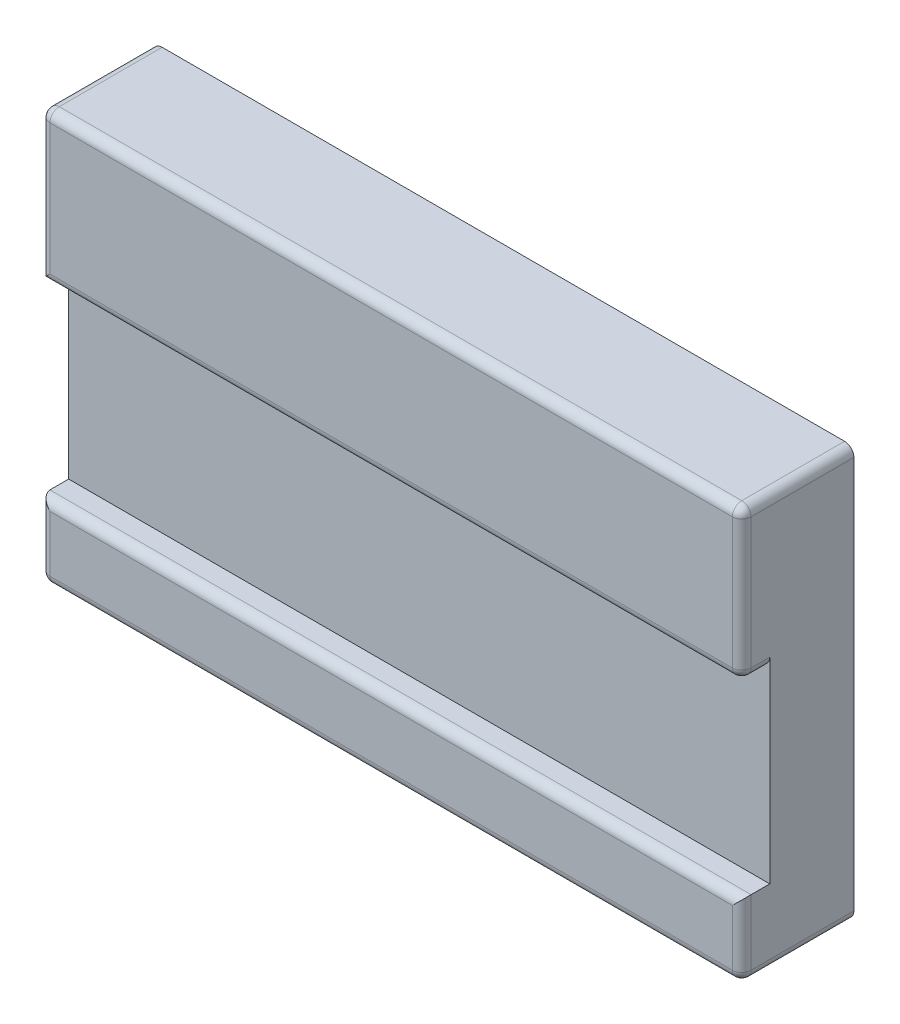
ISO-10303-21;
HEADER;
FILE_DESCRIPTION(('STEP AP214'),'2;1');
FILE_NAME('part.step','',(''),(''),'','','');
FILE_SCHEMA(('AUTOMOTIVE_DESIGN { 1 0 10303 214 1 1 1 1 }'));
ENDSEC;
DATA;
#1=APPLICATION_CONTEXT('core data for automotive mechanical design processes');
#2=APPLICATION_PROTOCOL_DEFINITION('international standard','automotive_design',2000,#1);
#3=PRODUCT_CONTEXT('',#1,'mechanical');
#4=PRODUCT('Part','Part','',(#3));
#5=PRODUCT_RELATED_PRODUCT_CATEGORY('part','',(#4));
#6=PRODUCT_DEFINITION_FORMATION('','',#4);
#7=PRODUCT_DEFINITION_CONTEXT('part definition',#1,'design');
#8=PRODUCT_DEFINITION('design','',#6,#7);
#9=PRODUCT_DEFINITION_SHAPE('','',#8);
#10=(LENGTH_UNIT() NAMED_UNIT(*) SI_UNIT(.MILLI.,.METRE.));
#11=(NAMED_UNIT(*) PLANE_ANGLE_UNIT() SI_UNIT($,.RADIAN.));
#12=(NAMED_UNIT(*) SI_UNIT($,.STERADIAN.) SOLID_ANGLE_UNIT());
#13=UNCERTAINTY_MEASURE_WITH_UNIT(LENGTH_MEASURE(1.E-05),#10,'distance_accuracy_value','');
#14=(GEOMETRIC_REPRESENTATION_CONTEXT(3) GLOBAL_UNCERTAINTY_ASSIGNED_CONTEXT((#13)) GLOBAL_UNIT_ASSIGNED_CONTEXT((#10,
#11,#12)) REPRESENTATION_CONTEXT('',''));
#15=CARTESIAN_POINT('',(0.,0.,0.));
#16=DIRECTION('',(0.,0.,1.));
#17=DIRECTION('',(1.,0.,0.));
#18=AXIS2_PLACEMENT_3D('',#15,#16,#17);
#19=CARTESIAN_POINT('',(0.,44.,0.));
#20=DIRECTION('',(0.,0.,1.));
#21=DIRECTION('',(1.,0.,0.));
#22=AXIS2_PLACEMENT_3D('',#19,#20,#21);
#23=PLANE('',#22);
#24=DIRECTION('',(0.,1.,0.));
#25=VECTOR('',#24,1.);
#26=CARTESIAN_POINT('',(70.,6.,0.));
#27=LINE('',#26,#25);
#28=CARTESIAN_POINT('',(70.,6.,0.));
#29=VERTEX_POINT('',#28);
#30=CARTESIAN_POINT('',(70.,30.,0.));
#31=VERTEX_POINT('',#30);
#32=EDGE_CURVE('E261',#29,#31,#27,.T.);
#33=ORIENTED_EDGE('',*,*,#32,.T.);
#34=DIRECTION('',(1.,0.,0.));
#35=VECTOR('',#34,1.);
#36=CARTESIAN_POINT('',(39.,30.,0.));
#37=LINE('',#36,#35);
#38=CARTESIAN_POINT('',(39.,30.,0.));
#39=VERTEX_POINT('',#38);
#40=EDGE_CURVE('E300',#39,#31,#37,.T.);
#41=ORIENTED_EDGE('',*,*,#40,.F.);
#42=DIRECTION('',(0.,-1.,0.));
#43=VECTOR('',#42,1.);
#44=CARTESIAN_POINT('',(39.,30.,0.));
#45=LINE('',#44,#43);
#46=CARTESIAN_POINT('',(39.,6.,0.));
#47=VERTEX_POINT('',#46);
#48=EDGE_CURVE('E303',#39,#47,#45,.T.);
#49=ORIENTED_EDGE('',*,*,#48,.T.);
#50=DIRECTION('',(-1.,0.,0.));
#51=VECTOR('',#50,1.);
#52=CARTESIAN_POINT('',(70.,6.,0.));
#53=LINE('',#52,#51);
#54=EDGE_CURVE('E306',#29,#47,#53,.T.);
#55=ORIENTED_EDGE('',*,*,#54,.F.);
#56=EDGE_LOOP('',(#33,#41,#49,#55));
#57=FACE_BOUND('',#56,.T.);
#58=DIRECTION('',(-1.,0.,0.));
#59=VECTOR('',#58,1.);
#60=CARTESIAN_POINT('',(75.,44.,0.));
#61=LINE('',#60,#59);
#62=CARTESIAN_POINT('',(74.,44.,0.));
#63=VERTEX_POINT('',#62);
#64=CARTESIAN_POINT('',(1.,44.,0.));
#65=VERTEX_POINT('',#64);
#66=EDGE_CURVE('E405',#63,#65,#61,.T.);
#67=ORIENTED_EDGE('',*,*,#66,.F.);
#68=CARTESIAN_POINT('',(74.,43.,0.));
#69=DIRECTION('',(0.,0.,1.));
#70=DIRECTION('',(1.,0.,0.));
#71=AXIS2_PLACEMENT_3D('',#68,#69,#70);
#72=CIRCLE('',#71,1.);
#73=CARTESIAN_POINT('',(75.,43.,0.));
#74=VERTEX_POINT('',#73);
#75=EDGE_CURVE('E494',#63,#74,#72,.F.);
#76=ORIENTED_EDGE('',*,*,#75,.T.);
#77=DIRECTION('',(0.,-1.,0.));
#78=VECTOR('',#77,1.);
#79=CARTESIAN_POINT('',(75.,44.,0.));
#80=LINE('',#79,#78);
#81=CARTESIAN_POINT('',(75.,1.,0.));
#82=VERTEX_POINT('',#81);
#83=EDGE_CURVE('E408',#74,#82,#80,.T.);
#84=ORIENTED_EDGE('',*,*,#83,.T.);
#85=CARTESIAN_POINT('',(74.,1.,0.));
#86=DIRECTION('',(0.,0.,1.));
#87=DIRECTION('',(1.,0.,0.));
#88=AXIS2_PLACEMENT_3D('',#85,#86,#87);
#89=CIRCLE('',#88,1.);
#90=CARTESIAN_POINT('',(74.,0.,0.));
#91=VERTEX_POINT('',#90);
#92=EDGE_CURVE('E492',#82,#91,#89,.F.);
#93=ORIENTED_EDGE('',*,*,#92,.T.);
#94=DIRECTION('',(1.,0.,0.));
#95=VECTOR('',#94,1.);
#96=CARTESIAN_POINT('',(0.,0.,0.));
#97=LINE('',#96,#95);
#98=CARTESIAN_POINT('',(59.,0.,0.));
#99=VERTEX_POINT('',#98);
#100=EDGE_CURVE('E411',#99,#91,#97,.T.);
#101=ORIENTED_EDGE('',*,*,#100,.F.);
#102=DIRECTION('',(0.,1.,0.));
#103=VECTOR('',#102,1.);
#104=CARTESIAN_POINT('',(59.,-5.,0.));
#105=LINE('',#104,#103);
#106=CARTESIAN_POINT('',(59.,-5.,0.));
#107=VERTEX_POINT('',#106);
#108=EDGE_CURVE('E350',#107,#99,#105,.T.);
#109=ORIENTED_EDGE('',*,*,#108,.F.);
#110=DIRECTION('',(1.,0.,0.));
#111=VECTOR('',#110,1.);
#112=CARTESIAN_POINT('',(55.,-5.,0.));
#113=LINE('',#112,#111);
#114=CARTESIAN_POINT('',(55.,-5.,0.));
#115=VERTEX_POINT('',#114);
#116=EDGE_CURVE('E343',#115,#107,#113,.T.);
#117=ORIENTED_EDGE('',*,*,#116,.F.);
#118=DIRECTION('',(0.,1.,0.));
#119=VECTOR('',#118,1.);
#120=CARTESIAN_POINT('',(55.,-5.,0.));
#121=LINE('',#120,#119);
#122=CARTESIAN_POINT('',(55.,0.,0.));
#123=VERTEX_POINT('',#122);
#124=EDGE_CURVE('E353',#115,#123,#121,.T.);
#125=ORIENTED_EDGE('',*,*,#124,.T.);
#126=CARTESIAN_POINT('',(20.,0.,0.));
#127=VERTEX_POINT('',#126);
#128=EDGE_CURVE('E415',#127,#123,#97,.T.);
#129=ORIENTED_EDGE('',*,*,#128,.F.);
#130=DIRECTION('',(0.,1.,0.));
#131=VECTOR('',#130,1.);
#132=CARTESIAN_POINT('',(20.,-5.,0.));
#133=LINE('',#132,#131);
#134=CARTESIAN_POINT('',(20.,-5.,0.));
#135=VERTEX_POINT('',#134);
#136=EDGE_CURVE('E377',#135,#127,#133,.T.);
#137=ORIENTED_EDGE('',*,*,#136,.F.);
#138=DIRECTION('',(1.,0.,0.));
#139=VECTOR('',#138,1.);
#140=CARTESIAN_POINT('',(16.,-5.,0.));
#141=LINE('',#140,#139);
#142=CARTESIAN_POINT('',(16.,-5.,0.));
#143=VERTEX_POINT('',#142);
#144=EDGE_CURVE('E370',#143,#135,#141,.T.);
#145=ORIENTED_EDGE('',*,*,#144,.F.);
#146=DIRECTION('',(0.,1.,0.));
#147=VECTOR('',#146,1.);
#148=CARTESIAN_POINT('',(16.,-5.,0.));
#149=LINE('',#148,#147);
#150=CARTESIAN_POINT('',(16.,0.,0.));
#151=VERTEX_POINT('',#150);
#152=EDGE_CURVE('E380',#143,#151,#149,.T.);
#153=ORIENTED_EDGE('',*,*,#152,.T.);
#154=CARTESIAN_POINT('',(1.,0.,0.));
#155=VERTEX_POINT('',#154);
#156=EDGE_CURVE('E412',#155,#151,#97,.T.);
#157=ORIENTED_EDGE('',*,*,#156,.F.);
#158=CARTESIAN_POINT('',(1.,1.,0.));
#159=DIRECTION('',(0.,0.,1.));
#160=DIRECTION('',(1.,0.,0.));
#161=AXIS2_PLACEMENT_3D('',#158,#159,#160);
#162=CIRCLE('',#161,1.);
#163=CARTESIAN_POINT('',(0.,1.,0.));
#164=VERTEX_POINT('',#163);
#165=EDGE_CURVE('E488',#155,#164,#162,.F.);
#166=ORIENTED_EDGE('',*,*,#165,.T.);
#167=DIRECTION('',(0.,1.,0.));
#168=VECTOR('',#167,1.);
#169=CARTESIAN_POINT('',(0.,0.,0.));
#170=LINE('',#169,#168);
#171=CARTESIAN_POINT('',(0.,43.,0.));
#172=VERTEX_POINT('',#171);
#173=EDGE_CURVE('E402',#164,#172,#170,.T.);
#174=ORIENTED_EDGE('',*,*,#173,.T.);
#175=CARTESIAN_POINT('',(1.,43.,0.));
#176=DIRECTION('',(0.,0.,1.));
#177=DIRECTION('',(1.,0.,0.));
#178=AXIS2_PLACEMENT_3D('',#175,#176,#177);
#179=CIRCLE('',#178,1.);
#180=EDGE_CURVE('E490',#172,#65,#179,.F.);
#181=ORIENTED_EDGE('',*,*,#180,.T.);
#182=EDGE_LOOP('',(#67,#76,#84,#93,#101,#109,#117,#125,#129,#137,#145,#153,#157,#166,#174,#181));
#183=FACE_BOUND('',#182,.T.);
#184=DIRECTION('',(0.,1.,0.));
#185=VECTOR('',#184,1.);
#186=CARTESIAN_POINT('',(36.,6.,0.));
#187=LINE('',#186,#185);
#188=CARTESIAN_POINT('',(36.,6.,0.));
#189=VERTEX_POINT('',#188);
#190=CARTESIAN_POINT('',(36.,30.,0.));
#191=VERTEX_POINT('',#190);
#192=EDGE_CURVE('E254',#189,#191,#187,.T.);
#193=ORIENTED_EDGE('',*,*,#192,.T.);
#194=DIRECTION('',(1.,0.,0.));
#195=VECTOR('',#194,1.);
#196=CARTESIAN_POINT('',(5.,30.,0.));
#197=LINE('',#196,#195);
#198=CARTESIAN_POINT('',(5.,30.,0.));
#199=VERTEX_POINT('',#198);
#200=EDGE_CURVE('E265',#199,#191,#197,.T.);
#201=ORIENTED_EDGE('',*,*,#200,.F.);
#202=DIRECTION('',(0.,-1.,0.));
#203=VECTOR('',#202,1.);
#204=CARTESIAN_POINT('',(5.,30.,0.));
#205=LINE('',#204,#203);
#206=CARTESIAN_POINT('',(5.,6.,0.));
#207=VERTEX_POINT('',#206);
#208=EDGE_CURVE('E270',#199,#207,#205,.T.);
#209=ORIENTED_EDGE('',*,*,#208,.T.);
#210=DIRECTION('',(-1.,0.,0.));
#211=VECTOR('',#210,1.);
#212=CARTESIAN_POINT('',(36.,6.,0.));
#213=LINE('',#212,#211);
#214=EDGE_CURVE('E274',#189,#207,#213,.T.);
#215=ORIENTED_EDGE('',*,*,#214,.F.);
#216=EDGE_LOOP('',(#193,#201,#209,#215));
#217=FACE_BOUND('',#216,.T.);
#218=ADVANCED_FACE('F26',(#57,#183,#217),#23,.F.);
#219=CARTESIAN_POINT('',(0.,0.,12.));
#220=DIRECTION('',(-1.,0.,0.));
#221=DIRECTION('',(0.,0.,1.));
#222=AXIS2_PLACEMENT_3D('',#219,#220,#221);
#223=PLANE('',#222);
#224=DIRECTION('',(0.,1.,0.));
#225=VECTOR('',#224,1.);
#226=CARTESIAN_POINT('',(0.,0.,11.));
#227=LINE('',#226,#225);
#228=CARTESIAN_POINT('',(0.,28.,11.));
#229=VERTEX_POINT('',#228);
#230=CARTESIAN_POINT('',(0.,43.,11.));
#231=VERTEX_POINT('',#230);
#232=EDGE_CURVE('E431',#229,#231,#227,.T.);
#233=ORIENTED_EDGE('',*,*,#232,.T.);
#234=DIRECTION('',(0.,0.,-1.));
#235=VECTOR('',#234,1.);
#236=CARTESIAN_POINT('',(0.,43.,12.));
#237=LINE('',#236,#235);
#238=EDGE_CURVE('E502',#231,#172,#237,.T.);
#239=ORIENTED_EDGE('',*,*,#238,.T.);
#240=ORIENTED_EDGE('',*,*,#173,.F.);
#241=DIRECTION('',(0.,0.,-1.));
#242=VECTOR('',#241,1.);
#243=CARTESIAN_POINT('',(0.,1.,12.));
#244=LINE('',#243,#242);
#245=CARTESIAN_POINT('',(0.,1.,11.));
#246=VERTEX_POINT('',#245);
#247=EDGE_CURVE('E500',#164,#246,#244,.F.);
#248=ORIENTED_EDGE('',*,*,#247,.T.);
#249=DIRECTION('',(0.,1.,0.));
#250=VECTOR('',#249,1.);
#251=CARTESIAN_POINT('',(0.,0.,11.));
#252=LINE('',#251,#250);
#253=CARTESIAN_POINT('',(0.,8.00000000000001,11.));
#254=VERTEX_POINT('',#253);
#255=EDGE_CURVE('E429',#246,#254,#252,.T.);
#256=ORIENTED_EDGE('',*,*,#255,.T.);
#257=DIRECTION('',(0.,0.,1.));
#258=VECTOR('',#257,1.);
#259=CARTESIAN_POINT('',(0.,8.00000000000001,9.));
#260=LINE('',#259,#258);
#261=CARTESIAN_POINT('',(0.,8.00000000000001,9.));
#262=VERTEX_POINT('',#261);
#263=EDGE_CURVE('E393',#262,#254,#260,.T.);
#264=ORIENTED_EDGE('',*,*,#263,.F.);
#265=DIRECTION('',(0.,-1.,0.));
#266=VECTOR('',#265,1.);
#267=CARTESIAN_POINT('',(0.,28.,9.));
#268=LINE('',#267,#266);
#269=CARTESIAN_POINT('',(0.,28.,9.));
#270=VERTEX_POINT('',#269);
#271=EDGE_CURVE('E383',#270,#262,#268,.T.);
#272=ORIENTED_EDGE('',*,*,#271,.F.);
#273=DIRECTION('',(0.,0.,1.));
#274=VECTOR('',#273,1.);
#275=CARTESIAN_POINT('',(0.,28.,9.));
#276=LINE('',#275,#274);
#277=EDGE_CURVE('E399',#270,#229,#276,.T.);
#278=ORIENTED_EDGE('',*,*,#277,.T.);
#279=EDGE_LOOP('',(#233,#239,#240,#248,#256,#264,#272,#278));
#280=FACE_BOUND('',#279,.T.);
#281=ADVANCED_FACE('F547',(#280),#223,.T.);
#282=CARTESIAN_POINT('',(75.,44.,12.));
#283=DIRECTION('',(1.,0.,0.));
#284=DIRECTION('',(0.,0.,-1.));
#285=AXIS2_PLACEMENT_3D('',#282,#283,#284);
#286=PLANE('',#285);
#287=DIRECTION('',(0.,0.,1.));
#288=VECTOR('',#287,1.);
#289=CARTESIAN_POINT('',(75.,29.,12.));
#290=LINE('',#289,#288);
#291=CARTESIAN_POINT('',(75.,29.,11.));
#292=VERTEX_POINT('',#291);
#293=CARTESIAN_POINT('',(75.,29.,9.));
#294=VERTEX_POINT('',#293);
#295=EDGE_CURVE('E460',#292,#294,#290,.F.);
#296=ORIENTED_EDGE('',*,*,#295,.T.);
#297=DIRECTION('',(0.,1.,0.));
#298=VECTOR('',#297,1.);
#299=CARTESIAN_POINT('',(75.,8.,9.));
#300=LINE('',#299,#298);
#301=CARTESIAN_POINT('',(75.,8.,9.));
#302=VERTEX_POINT('',#301);
#303=EDGE_CURVE('E388',#302,#294,#300,.T.);
#304=ORIENTED_EDGE('',*,*,#303,.F.);
#305=DIRECTION('',(0.,0.,1.));
#306=VECTOR('',#305,1.);
#307=CARTESIAN_POINT('',(75.,8.,9.));
#308=LINE('',#307,#306);
#309=CARTESIAN_POINT('',(75.,8.,11.));
#310=VERTEX_POINT('',#309);
#311=EDGE_CURVE('E396',#302,#310,#308,.T.);
#312=ORIENTED_EDGE('',*,*,#311,.T.);
#313=DIRECTION('',(0.,-1.,0.));
#314=VECTOR('',#313,1.);
#315=CARTESIAN_POINT('',(75.,44.,11.));
#316=LINE('',#315,#314);
#317=CARTESIAN_POINT('',(75.,1.,11.));
#318=VERTEX_POINT('',#317);
#319=EDGE_CURVE('E426',#310,#318,#316,.T.);
#320=ORIENTED_EDGE('',*,*,#319,.T.);
#321=DIRECTION('',(0.,0.,-1.));
#322=VECTOR('',#321,1.);
#323=CARTESIAN_POINT('',(75.,1.,12.));
#324=LINE('',#323,#322);
#325=EDGE_CURVE('E454',#318,#82,#324,.T.);
#326=ORIENTED_EDGE('',*,*,#325,.T.);
#327=ORIENTED_EDGE('',*,*,#83,.F.);
#328=DIRECTION('',(0.,0.,-1.));
#329=VECTOR('',#328,1.);
#330=CARTESIAN_POINT('',(75.,43.,12.));
#331=LINE('',#330,#329);
#332=CARTESIAN_POINT('',(75.,43.,11.));
#333=VERTEX_POINT('',#332);
#334=EDGE_CURVE('E456',#74,#333,#331,.F.);
#335=ORIENTED_EDGE('',*,*,#334,.T.);
#336=DIRECTION('',(0.,-1.,0.));
#337=VECTOR('',#336,1.);
#338=CARTESIAN_POINT('',(75.,44.,11.));
#339=LINE('',#338,#337);
#340=EDGE_CURVE('E458',#333,#292,#339,.T.);
#341=ORIENTED_EDGE('',*,*,#340,.T.);
#342=EDGE_LOOP('',(#296,#304,#312,#320,#326,#327,#335,#341));
#343=FACE_BOUND('',#342,.T.);
#344=ADVANCED_FACE('F553',(#343),#286,.T.);
#345=CARTESIAN_POINT('',(0.,44.,12.));
#346=DIRECTION('',(0.,0.,1.));
#347=DIRECTION('',(1.,0.,0.));
#348=AXIS2_PLACEMENT_3D('',#345,#346,#347);
#349=PLANE('',#348);
#350=DIRECTION('',(1.,0.,0.));
#351=VECTOR('',#350,1.);
#352=CARTESIAN_POINT('',(0.,29.,12.));
#353=LINE('',#352,#351);
#354=CARTESIAN_POINT('',(1.,29.,12.));
#355=VERTEX_POINT('',#354);
#356=CARTESIAN_POINT('',(74.,29.,12.));
#357=VERTEX_POINT('',#356);
#358=EDGE_CURVE('E414',#355,#357,#353,.T.);
#359=ORIENTED_EDGE('',*,*,#358,.T.);
#360=DIRECTION('',(0.,-1.,0.));
#361=VECTOR('',#360,1.);
#362=CARTESIAN_POINT('',(74.,44.,12.));
#363=LINE('',#362,#361);
#364=CARTESIAN_POINT('',(74.,43.,12.));
#365=VERTEX_POINT('',#364);
#366=EDGE_CURVE('E465',#357,#365,#363,.F.);
#367=ORIENTED_EDGE('',*,*,#366,.T.);
#368=DIRECTION('',(-1.,0.,0.));
#369=VECTOR('',#368,1.);
#370=CARTESIAN_POINT('',(0.,43.,12.));
#371=LINE('',#370,#369);
#372=CARTESIAN_POINT('',(1.,43.,12.));
#373=VERTEX_POINT('',#372);
#374=EDGE_CURVE('E420',#365,#373,#371,.T.);
#375=ORIENTED_EDGE('',*,*,#374,.T.);
#376=DIRECTION('',(0.,1.,0.));
#377=VECTOR('',#376,1.);
#378=CARTESIAN_POINT('',(1.,44.,12.));
#379=LINE('',#378,#377);
#380=EDGE_CURVE('E418',#373,#355,#379,.F.);
#381=ORIENTED_EDGE('',*,*,#380,.T.);
#382=EDGE_LOOP('',(#359,#367,#375,#381));
#383=FACE_BOUND('',#382,.T.);
#384=ADVANCED_FACE('F560',(#383),#349,.T.);
#385=DIRECTION('',(-1.,0.,0.));
#386=VECTOR('',#385,1.);
#387=CARTESIAN_POINT('',(0.,7.00000000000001,12.));
#388=LINE('',#387,#386);
#389=CARTESIAN_POINT('',(74.,7.,12.));
#390=VERTEX_POINT('',#389);
#391=CARTESIAN_POINT('',(1.,7.00000000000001,12.));
#392=VERTEX_POINT('',#391);
#393=EDGE_CURVE('E439',#390,#392,#388,.T.);
#394=ORIENTED_EDGE('',*,*,#393,.T.);
#395=DIRECTION('',(0.,1.,0.));
#396=VECTOR('',#395,1.);
#397=CARTESIAN_POINT('',(1.,44.,12.));
#398=LINE('',#397,#396);
#399=CARTESIAN_POINT('',(1.,1.,12.));
#400=VERTEX_POINT('',#399);
#401=EDGE_CURVE('E441',#392,#400,#398,.F.);
#402=ORIENTED_EDGE('',*,*,#401,.T.);
#403=DIRECTION('',(1.,0.,0.));
#404=VECTOR('',#403,1.);
#405=CARTESIAN_POINT('',(0.,1.,12.));
#406=LINE('',#405,#404);
#407=CARTESIAN_POINT('',(74.,1.,12.));
#408=VERTEX_POINT('',#407);
#409=EDGE_CURVE('E434',#400,#408,#406,.T.);
#410=ORIENTED_EDGE('',*,*,#409,.T.);
#411=DIRECTION('',(0.,-1.,0.));
#412=VECTOR('',#411,1.);
#413=CARTESIAN_POINT('',(74.,44.,12.));
#414=LINE('',#413,#412);
#415=EDGE_CURVE('E437',#408,#390,#414,.F.);
#416=ORIENTED_EDGE('',*,*,#415,.T.);
#417=EDGE_LOOP('',(#394,#402,#410,#416));
#418=FACE_BOUND('',#417,.T.);
#419=ADVANCED_FACE('F562',(#418),#349,.T.);
#420=CARTESIAN_POINT('',(0.,0.,12.));
#421=DIRECTION('',(0.,1.,0.));
#422=DIRECTION('',(0.,0.,1.));
#423=AXIS2_PLACEMENT_3D('',#420,#421,#422);
#424=PLANE('',#423);
#425=ORIENTED_EDGE('',*,*,#100,.T.);
#426=DIRECTION('',(0.,0.,-1.));
#427=VECTOR('',#426,1.);
#428=CARTESIAN_POINT('',(74.,0.,12.));
#429=LINE('',#428,#427);
#430=CARTESIAN_POINT('',(74.,0.,11.));
#431=VERTEX_POINT('',#430);
#432=EDGE_CURVE('E498',#91,#431,#429,.F.);
#433=ORIENTED_EDGE('',*,*,#432,.T.);
#434=DIRECTION('',(1.,0.,0.));
#435=VECTOR('',#434,1.);
#436=CARTESIAN_POINT('',(0.,0.,11.));
#437=LINE('',#436,#435);
#438=CARTESIAN_POINT('',(1.,0.,11.));
#439=VERTEX_POINT('',#438);
#440=EDGE_CURVE('E448',#431,#439,#437,.F.);
#441=ORIENTED_EDGE('',*,*,#440,.T.);
#442=DIRECTION('',(0.,0.,-1.));
#443=VECTOR('',#442,1.);
#444=CARTESIAN_POINT('',(1.,0.,12.));
#445=LINE('',#444,#443);
#446=EDGE_CURVE('E496',#439,#155,#445,.T.);
#447=ORIENTED_EDGE('',*,*,#446,.T.);
#448=ORIENTED_EDGE('',*,*,#156,.T.);
#449=DIRECTION('',(0.,0.,1.));
#450=VECTOR('',#449,1.);
#451=CARTESIAN_POINT('',(16.,0.,0.));
#452=LINE('',#451,#450);
#453=CARTESIAN_POINT('',(16.,0.,5.));
#454=VERTEX_POINT('',#453);
#455=EDGE_CURVE('E356',#151,#454,#452,.T.);
#456=ORIENTED_EDGE('',*,*,#455,.T.);
#457=DIRECTION('',(-1.,0.,0.));
#458=VECTOR('',#457,1.);
#459=CARTESIAN_POINT('',(20.,0.,5.));
#460=LINE('',#459,#458);
#461=CARTESIAN_POINT('',(20.,0.,5.));
#462=VERTEX_POINT('',#461);
#463=EDGE_CURVE('E359',#462,#454,#460,.T.);
#464=ORIENTED_EDGE('',*,*,#463,.F.);
#465=DIRECTION('',(0.,0.,-1.));
#466=VECTOR('',#465,1.);
#467=CARTESIAN_POINT('',(20.,0.,5.));
#468=LINE('',#467,#466);
#469=EDGE_CURVE('E362',#462,#127,#468,.T.);
#470=ORIENTED_EDGE('',*,*,#469,.T.);
#471=ORIENTED_EDGE('',*,*,#128,.T.);
#472=DIRECTION('',(0.,0.,1.));
#473=VECTOR('',#472,1.);
#474=CARTESIAN_POINT('',(55.,0.,0.));
#475=LINE('',#474,#473);
#476=CARTESIAN_POINT('',(55.,0.,5.));
#477=VERTEX_POINT('',#476);
#478=EDGE_CURVE('E330',#123,#477,#475,.T.);
#479=ORIENTED_EDGE('',*,*,#478,.T.);
#480=DIRECTION('',(-1.,0.,0.));
#481=VECTOR('',#480,1.);
#482=CARTESIAN_POINT('',(59.,0.,5.));
#483=LINE('',#482,#481);
#484=CARTESIAN_POINT('',(59.,0.,5.));
#485=VERTEX_POINT('',#484);
#486=EDGE_CURVE('E333',#485,#477,#483,.T.);
#487=ORIENTED_EDGE('',*,*,#486,.F.);
#488=DIRECTION('',(0.,0.,-1.));
#489=VECTOR('',#488,1.);
#490=CARTESIAN_POINT('',(59.,0.,5.));
#491=LINE('',#490,#489);
#492=EDGE_CURVE('E336',#485,#99,#491,.T.);
#493=ORIENTED_EDGE('',*,*,#492,.T.);
#494=EDGE_LOOP('',(#425,#433,#441,#447,#448,#456,#464,#470,#471,#479,#487,#493));
#495=FACE_BOUND('',#494,.T.);
#496=ADVANCED_FACE('F28',(#495),#424,.F.);
#497=CARTESIAN_POINT('',(75.,44.,12.));
#498=DIRECTION('',(0.,-1.,0.));
#499=DIRECTION('',(0.,0.,-1.));
#500=AXIS2_PLACEMENT_3D('',#497,#498,#499);
#501=PLANE('',#500);
#502=DIRECTION('',(-1.,0.,0.));
#503=VECTOR('',#502,1.);
#504=CARTESIAN_POINT('',(0.,44.,11.));
#505=LINE('',#504,#503);
#506=CARTESIAN_POINT('',(1.,44.,11.));
#507=VERTEX_POINT('',#506);
#508=CARTESIAN_POINT('',(74.,44.,11.));
#509=VERTEX_POINT('',#508);
#510=EDGE_CURVE('E423',#507,#509,#505,.F.);
#511=ORIENTED_EDGE('',*,*,#510,.T.);
#512=DIRECTION('',(0.,0.,-1.));
#513=VECTOR('',#512,1.);
#514=CARTESIAN_POINT('',(74.,44.,12.));
#515=LINE('',#514,#513);
#516=EDGE_CURVE('E486',#509,#63,#515,.T.);
#517=ORIENTED_EDGE('',*,*,#516,.T.);
#518=ORIENTED_EDGE('',*,*,#66,.T.);
#519=DIRECTION('',(0.,0.,-1.));
#520=VECTOR('',#519,1.);
#521=CARTESIAN_POINT('',(1.,44.,12.));
#522=LINE('',#521,#520);
#523=EDGE_CURVE('E484',#65,#507,#522,.F.);
#524=ORIENTED_EDGE('',*,*,#523,.T.);
#525=EDGE_LOOP('',(#511,#517,#518,#524));
#526=FACE_BOUND('',#525,.T.);
#527=ADVANCED_FACE('F565',(#526),#501,.F.);
#528=CARTESIAN_POINT('',(0.,28.,9.));
#529=DIRECTION('',(0.,-1.,0.));
#530=DIRECTION('',(0.,0.,-1.));
#531=AXIS2_PLACEMENT_3D('',#528,#529,#530);
#532=PLANE('',#531);
#533=DIRECTION('',(1.,0.,0.));
#534=VECTOR('',#533,1.);
#535=CARTESIAN_POINT('',(0.,28.,9.));
#536=LINE('',#535,#534);
#537=CARTESIAN_POINT('',(74.,28.,9.));
#538=VERTEX_POINT('',#537);
#539=EDGE_CURVE('E390',#270,#538,#536,.T.);
#540=ORIENTED_EDGE('',*,*,#539,.T.);
#541=DIRECTION('',(0.,0.,1.));
#542=VECTOR('',#541,1.);
#543=CARTESIAN_POINT('',(74.,28.,9.));
#544=LINE('',#543,#542);
#545=CARTESIAN_POINT('',(74.,28.,11.));
#546=VERTEX_POINT('',#545);
#547=EDGE_CURVE('E451',#538,#546,#544,.T.);
#548=ORIENTED_EDGE('',*,*,#547,.T.);
#549=DIRECTION('',(1.,0.,0.));
#550=VECTOR('',#549,1.);
#551=CARTESIAN_POINT('',(0.,28.,11.));
#552=LINE('',#551,#550);
#553=EDGE_CURVE('E446',#546,#229,#552,.F.);
#554=ORIENTED_EDGE('',*,*,#553,.T.);
#555=ORIENTED_EDGE('',*,*,#277,.F.);
#556=EDGE_LOOP('',(#540,#548,#554,#555));
#557=FACE_BOUND('',#556,.T.);
#558=ADVANCED_FACE('F558',(#557),#532,.T.);
#559=CARTESIAN_POINT('',(75.,8.,9.));
#560=DIRECTION('',(0.,1.,0.));
#561=DIRECTION('',(-1.,0.,0.));
#562=AXIS2_PLACEMENT_3D('',#559,#560,#561);
#563=PLANE('',#562);
#564=ORIENTED_EDGE('',*,*,#263,.T.);
#565=DIRECTION('',(-1.,0.,0.));
#566=VECTOR('',#565,1.);
#567=CARTESIAN_POINT('',(75.,8.,11.));
#568=LINE('',#567,#566);
#569=EDGE_CURVE('E444',#254,#310,#568,.F.);
#570=ORIENTED_EDGE('',*,*,#569,.T.);
#571=ORIENTED_EDGE('',*,*,#311,.F.);
#572=DIRECTION('',(-1.,0.,0.));
#573=VECTOR('',#572,1.);
#574=CARTESIAN_POINT('',(75.,8.,9.));
#575=LINE('',#574,#573);
#576=EDGE_CURVE('E385',#302,#262,#575,.T.);
#577=ORIENTED_EDGE('',*,*,#576,.T.);
#578=EDGE_LOOP('',(#564,#570,#571,#577));
#579=FACE_BOUND('',#578,.T.);
#580=ADVANCED_FACE('F704',(#579),#563,.T.);
#581=CARTESIAN_POINT('',(0.,28.,9.));
#582=DIRECTION('',(0.,0.,1.));
#583=DIRECTION('',(1.,0.,0.));
#584=AXIS2_PLACEMENT_3D('',#581,#582,#583);
#585=PLANE('',#584);
#586=ORIENTED_EDGE('',*,*,#271,.T.);
#587=ORIENTED_EDGE('',*,*,#576,.F.);
#588=ORIENTED_EDGE('',*,*,#303,.T.);
#589=CARTESIAN_POINT('',(74.,29.,9.));
#590=DIRECTION('',(0.,0.,1.));
#591=DIRECTION('',(1.,0.,0.));
#592=AXIS2_PLACEMENT_3D('',#589,#590,#591);
#593=CIRCLE('',#592,1.);
#594=EDGE_CURVE('E504',#294,#538,#593,.F.);
#595=ORIENTED_EDGE('',*,*,#594,.T.);
#596=ORIENTED_EDGE('',*,*,#539,.F.);
#597=EDGE_LOOP('',(#586,#587,#588,#595,#596));
#598=FACE_BOUND('',#597,.T.);
#599=ADVANCED_FACE('F583',(#598),#585,.T.);
#600=CARTESIAN_POINT('',(16.,-5.,0.));
#601=DIRECTION('',(-1.,0.,0.));
#602=DIRECTION('',(0.,0.,1.));
#603=AXIS2_PLACEMENT_3D('',#600,#601,#602);
#604=PLANE('',#603);
#605=DIRECTION('',(0.,0.,1.));
#606=VECTOR('',#605,1.);
#607=CARTESIAN_POINT('',(16.,-5.,0.));
#608=LINE('',#607,#606);
#609=CARTESIAN_POINT('',(16.,-5.,3.99999999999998));
#610=VERTEX_POINT('',#609);
#611=EDGE_CURVE('E365',#143,#610,#608,.T.);
#612=ORIENTED_EDGE('',*,*,#611,.T.);
#613=DIRECTION('',(0.,-0.707106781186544,-0.707106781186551));
#614=VECTOR('',#613,1.);
#615=CARTESIAN_POINT('',(16.,-6.99999999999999,1.99999999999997));
#616=LINE('',#615,#614);
#617=CARTESIAN_POINT('',(16.,-3.99999999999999,5.));
#618=VERTEX_POINT('',#617);
#619=EDGE_CURVE('E509',#610,#618,#616,.F.);
#620=ORIENTED_EDGE('',*,*,#619,.T.);
#621=DIRECTION('',(0.,1.,0.));
#622=VECTOR('',#621,1.);
#623=CARTESIAN_POINT('',(16.,-5.,5.));
#624=LINE('',#623,#622);
#625=EDGE_CURVE('E373',#618,#454,#624,.T.);
#626=ORIENTED_EDGE('',*,*,#625,.T.);
#627=ORIENTED_EDGE('',*,*,#455,.F.);
#628=ORIENTED_EDGE('',*,*,#152,.F.);
#629=EDGE_LOOP('',(#612,#620,#626,#627,#628));
#630=FACE_BOUND('',#629,.T.);
#631=ADVANCED_FACE('F674',(#630),#604,.T.);
#632=CARTESIAN_POINT('',(20.,-5.,5.));
#633=DIRECTION('',(1.,0.,0.));
#634=DIRECTION('',(0.,0.,-1.));
#635=AXIS2_PLACEMENT_3D('',#632,#633,#634);
#636=PLANE('',#635);
#637=DIRECTION('',(0.,1.,0.));
#638=VECTOR('',#637,1.);
#639=CARTESIAN_POINT('',(20.,-5.,5.));
#640=LINE('',#639,#638);
#641=CARTESIAN_POINT('',(20.,-3.99999999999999,5.));
#642=VERTEX_POINT('',#641);
#643=EDGE_CURVE('E375',#642,#462,#640,.T.);
#644=ORIENTED_EDGE('',*,*,#643,.F.);
#645=DIRECTION('',(0.,0.707106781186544,0.707106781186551));
#646=VECTOR('',#645,1.);
#647=CARTESIAN_POINT('',(20.,-4.49999999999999,4.5));
#648=LINE('',#647,#646);
#649=CARTESIAN_POINT('',(20.,-5.,3.99999999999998));
#650=VERTEX_POINT('',#649);
#651=EDGE_CURVE('E513',#642,#650,#648,.F.);
#652=ORIENTED_EDGE('',*,*,#651,.T.);
#653=DIRECTION('',(0.,0.,-1.));
#654=VECTOR('',#653,1.);
#655=CARTESIAN_POINT('',(20.,-5.,5.));
#656=LINE('',#655,#654);
#657=EDGE_CURVE('E368',#650,#135,#656,.T.);
#658=ORIENTED_EDGE('',*,*,#657,.T.);
#659=ORIENTED_EDGE('',*,*,#136,.T.);
#660=ORIENTED_EDGE('',*,*,#469,.F.);
#661=EDGE_LOOP('',(#644,#652,#658,#659,#660));
#662=FACE_BOUND('',#661,.T.);
#663=ADVANCED_FACE('F684',(#662),#636,.T.);
#664=CARTESIAN_POINT('',(20.,-5.,5.));
#665=DIRECTION('',(0.,0.,-1.));
#666=DIRECTION('',(-1.,0.,0.));
#667=AXIS2_PLACEMENT_3D('',#664,#665,#666);
#668=PLANE('',#667);
#669=ORIENTED_EDGE('',*,*,#625,.F.);
#670=DIRECTION('',(1.,0.,0.));
#671=VECTOR('',#670,1.);
#672=CARTESIAN_POINT('',(20.,-3.99999999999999,5.));
#673=LINE('',#672,#671);
#674=EDGE_CURVE('E511',#618,#642,#673,.T.);
#675=ORIENTED_EDGE('',*,*,#674,.T.);
#676=ORIENTED_EDGE('',*,*,#643,.T.);
#677=ORIENTED_EDGE('',*,*,#463,.T.);
#678=EDGE_LOOP('',(#669,#675,#676,#677));
#679=FACE_BOUND('',#678,.T.);
#680=ADVANCED_FACE('F679',(#679),#668,.F.);
#681=CARTESIAN_POINT('',(16.,-5.,0.));
#682=DIRECTION('',(0.,1.,0.));
#683=DIRECTION('',(0.,0.,1.));
#684=AXIS2_PLACEMENT_3D('',#681,#682,#683);
#685=PLANE('',#684);
#686=ORIENTED_EDGE('',*,*,#657,.F.);
#687=DIRECTION('',(-1.,0.,0.));
#688=VECTOR('',#687,1.);
#689=CARTESIAN_POINT('',(16.,-5.,3.99999999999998));
#690=LINE('',#689,#688);
#691=EDGE_CURVE('E506',#650,#610,#690,.T.);
#692=ORIENTED_EDGE('',*,*,#691,.T.);
#693=ORIENTED_EDGE('',*,*,#611,.F.);
#694=ORIENTED_EDGE('',*,*,#144,.T.);
#695=EDGE_LOOP('',(#686,#692,#693,#694));
#696=FACE_BOUND('',#695,.T.);
#697=ADVANCED_FACE('F688',(#696),#685,.F.);
#698=CARTESIAN_POINT('',(55.,-5.,0.));
#699=DIRECTION('',(-1.,0.,0.));
#700=DIRECTION('',(0.,0.,1.));
#701=AXIS2_PLACEMENT_3D('',#698,#699,#700);
#702=PLANE('',#701);
#703=DIRECTION('',(0.,0.,1.));
#704=VECTOR('',#703,1.);
#705=CARTESIAN_POINT('',(55.,-5.,0.));
#706=LINE('',#705,#704);
#707=CARTESIAN_POINT('',(55.,-5.,3.99999999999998));
#708=VERTEX_POINT('',#707);
#709=EDGE_CURVE('E339',#115,#708,#706,.T.);
#710=ORIENTED_EDGE('',*,*,#709,.T.);
#711=DIRECTION('',(0.,0.707106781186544,0.707106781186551));
#712=VECTOR('',#711,1.);
#713=CARTESIAN_POINT('',(55.,-6.99999999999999,1.99999999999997));
#714=LINE('',#713,#712);
#715=CARTESIAN_POINT('',(55.,-3.99999999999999,5.));
#716=VERTEX_POINT('',#715);
#717=EDGE_CURVE('E48',#708,#716,#714,.T.);
#718=ORIENTED_EDGE('',*,*,#717,.T.);
#719=DIRECTION('',(0.,1.,0.));
#720=VECTOR('',#719,1.);
#721=CARTESIAN_POINT('',(55.,-5.,5.));
#722=LINE('',#721,#720);
#723=EDGE_CURVE('E346',#716,#477,#722,.T.);
#724=ORIENTED_EDGE('',*,*,#723,.T.);
#725=ORIENTED_EDGE('',*,*,#478,.F.);
#726=ORIENTED_EDGE('',*,*,#124,.F.);
#727=EDGE_LOOP('',(#710,#718,#724,#725,#726));
#728=FACE_BOUND('',#727,.T.);
#729=ADVANCED_FACE('F526',(#728),#702,.T.);
#730=CARTESIAN_POINT('',(59.,-5.,5.));
#731=DIRECTION('',(1.,0.,0.));
#732=DIRECTION('',(0.,0.,-1.));
#733=AXIS2_PLACEMENT_3D('',#730,#731,#732);
#734=PLANE('',#733);
#735=DIRECTION('',(0.,1.,0.));
#736=VECTOR('',#735,1.);
#737=CARTESIAN_POINT('',(59.,-5.,5.));
#738=LINE('',#737,#736);
#739=CARTESIAN_POINT('',(59.,-3.99999999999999,5.));
#740=VERTEX_POINT('',#739);
#741=EDGE_CURVE('E348',#740,#485,#738,.T.);
#742=ORIENTED_EDGE('',*,*,#741,.F.);
#743=DIRECTION('',(0.,-0.707106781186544,-0.707106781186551));
#744=VECTOR('',#743,1.);
#745=CARTESIAN_POINT('',(59.,-4.49999999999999,4.5));
#746=LINE('',#745,#744);
#747=CARTESIAN_POINT('',(59.,-5.,3.99999999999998));
#748=VERTEX_POINT('',#747);
#749=EDGE_CURVE('E11',#740,#748,#746,.T.);
#750=ORIENTED_EDGE('',*,*,#749,.T.);
#751=DIRECTION('',(0.,0.,-1.));
#752=VECTOR('',#751,1.);
#753=CARTESIAN_POINT('',(59.,-5.,5.));
#754=LINE('',#753,#752);
#755=EDGE_CURVE('E341',#748,#107,#754,.T.);
#756=ORIENTED_EDGE('',*,*,#755,.T.);
#757=ORIENTED_EDGE('',*,*,#108,.T.);
#758=ORIENTED_EDGE('',*,*,#492,.F.);
#759=EDGE_LOOP('',(#742,#750,#756,#757,#758));
#760=FACE_BOUND('',#759,.T.);
#761=ADVANCED_FACE('F535',(#760),#734,.T.);
#762=CARTESIAN_POINT('',(59.,-5.,5.));
#763=DIRECTION('',(0.,0.,-1.));
#764=DIRECTION('',(-1.,0.,0.));
#765=AXIS2_PLACEMENT_3D('',#762,#763,#764);
#766=PLANE('',#765);
#767=ORIENTED_EDGE('',*,*,#723,.F.);
#768=DIRECTION('',(1.,0.,0.));
#769=VECTOR('',#768,1.);
#770=CARTESIAN_POINT('',(59.,-3.99999999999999,5.));
#771=LINE('',#770,#769);
#772=EDGE_CURVE('E34',#716,#740,#771,.T.);
#773=ORIENTED_EDGE('',*,*,#772,.T.);
#774=ORIENTED_EDGE('',*,*,#741,.T.);
#775=ORIENTED_EDGE('',*,*,#486,.T.);
#776=EDGE_LOOP('',(#767,#773,#774,#775));
#777=FACE_BOUND('',#776,.T.);
#778=ADVANCED_FACE('F763',(#777),#766,.F.);
#779=CARTESIAN_POINT('',(55.,-5.,5.));
#780=DIRECTION('',(0.,-1.,0.));
#781=DIRECTION('',(0.,0.,-1.));
#782=AXIS2_PLACEMENT_3D('',#779,#780,#781);
#783=PLANE('',#782);
#784=ORIENTED_EDGE('',*,*,#755,.F.);
#785=DIRECTION('',(-1.,0.,0.));
#786=VECTOR('',#785,1.);
#787=CARTESIAN_POINT('',(55.,-5.,3.99999999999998));
#788=LINE('',#787,#786);
#789=EDGE_CURVE('E515',#748,#708,#788,.T.);
#790=ORIENTED_EDGE('',*,*,#789,.T.);
#791=ORIENTED_EDGE('',*,*,#709,.F.);
#792=ORIENTED_EDGE('',*,*,#116,.T.);
#793=EDGE_LOOP('',(#784,#790,#791,#792));
#794=FACE_BOUND('',#793,.T.);
#795=ADVANCED_FACE('F522',(#794),#783,.T.);
#796=CARTESIAN_POINT('',(70.,6.,7.));
#797=DIRECTION('',(-1.,0.,0.));
#798=DIRECTION('',(0.,0.,1.));
#799=AXIS2_PLACEMENT_3D('',#796,#797,#798);
#800=PLANE('',#799);
#801=DIRECTION('',(0.,0.,-1.));
#802=VECTOR('',#801,1.);
#803=CARTESIAN_POINT('',(70.,30.,7.));
#804=LINE('',#803,#802);
#805=CARTESIAN_POINT('',(70.,30.,7.));
#806=VERTEX_POINT('',#805);
#807=EDGE_CURVE('E328',#806,#31,#804,.T.);
#808=ORIENTED_EDGE('',*,*,#807,.T.);
#809=ORIENTED_EDGE('',*,*,#32,.F.);
#810=DIRECTION('',(0.,0.,-1.));
#811=VECTOR('',#810,1.);
#812=CARTESIAN_POINT('',(70.,6.,7.));
#813=LINE('',#812,#811);
#814=CARTESIAN_POINT('',(70.,6.,7.));
#815=VERTEX_POINT('',#814);
#816=EDGE_CURVE('E321',#815,#29,#813,.T.);
#817=ORIENTED_EDGE('',*,*,#816,.F.);
#818=DIRECTION('',(0.,1.,0.));
#819=VECTOR('',#818,1.);
#820=CARTESIAN_POINT('',(70.,6.,7.));
#821=LINE('',#820,#819);
#822=EDGE_CURVE('E309',#815,#806,#821,.T.);
#823=ORIENTED_EDGE('',*,*,#822,.T.);
#824=EDGE_LOOP('',(#808,#809,#817,#823));
#825=FACE_BOUND('',#824,.T.);
#826=ADVANCED_FACE('F758',(#825),#800,.T.);
#827=CARTESIAN_POINT('',(39.,30.,7.));
#828=DIRECTION('',(0.,1.,0.));
#829=DIRECTION('',(0.,0.,1.));
#830=AXIS2_PLACEMENT_3D('',#827,#828,#829);
#831=PLANE('',#830);
#832=DIRECTION('',(0.,0.,-1.));
#833=VECTOR('',#832,1.);
#834=CARTESIAN_POINT('',(39.,30.,7.));
#835=LINE('',#834,#833);
#836=CARTESIAN_POINT('',(39.,30.,7.));
#837=VERTEX_POINT('',#836);
#838=EDGE_CURVE('E326',#837,#39,#835,.T.);
#839=ORIENTED_EDGE('',*,*,#838,.T.);
#840=ORIENTED_EDGE('',*,*,#40,.T.);
#841=ORIENTED_EDGE('',*,*,#807,.F.);
#842=DIRECTION('',(1.,0.,0.));
#843=VECTOR('',#842,1.);
#844=CARTESIAN_POINT('',(39.,30.,7.));
#845=LINE('',#844,#843);
#846=EDGE_CURVE('E312',#837,#806,#845,.T.);
#847=ORIENTED_EDGE('',*,*,#846,.F.);
#848=EDGE_LOOP('',(#839,#840,#841,#847));
#849=FACE_BOUND('',#848,.T.);
#850=ADVANCED_FACE('F761',(#849),#831,.F.);
#851=CARTESIAN_POINT('',(39.,30.,7.));
#852=DIRECTION('',(1.,0.,0.));
#853=DIRECTION('',(0.,0.,-1.));
#854=AXIS2_PLACEMENT_3D('',#851,#852,#853);
#855=PLANE('',#854);
#856=DIRECTION('',(0.,0.,-1.));
#857=VECTOR('',#856,1.);
#858=CARTESIAN_POINT('',(39.,6.,7.));
#859=LINE('',#858,#857);
#860=CARTESIAN_POINT('',(39.,6.,7.));
#861=VERTEX_POINT('',#860);
#862=EDGE_CURVE('E324',#861,#47,#859,.T.);
#863=ORIENTED_EDGE('',*,*,#862,.T.);
#864=ORIENTED_EDGE('',*,*,#48,.F.);
#865=ORIENTED_EDGE('',*,*,#838,.F.);
#866=DIRECTION('',(0.,-1.,0.));
#867=VECTOR('',#866,1.);
#868=CARTESIAN_POINT('',(39.,30.,7.));
#869=LINE('',#868,#867);
#870=EDGE_CURVE('E315',#837,#861,#869,.T.);
#871=ORIENTED_EDGE('',*,*,#870,.T.);
#872=EDGE_LOOP('',(#863,#864,#865,#871));
#873=FACE_BOUND('',#872,.T.);
#874=ADVANCED_FACE('F757',(#873),#855,.T.);
#875=CARTESIAN_POINT('',(70.,6.,7.));
#876=DIRECTION('',(0.,-1.,0.));
#877=DIRECTION('',(1.,0.,0.));
#878=AXIS2_PLACEMENT_3D('',#875,#876,#877);
#879=PLANE('',#878);
#880=DIRECTION('',(-1.,0.,0.));
#881=VECTOR('',#880,1.);
#882=CARTESIAN_POINT('',(70.,6.,7.));
#883=LINE('',#882,#881);
#884=EDGE_CURVE('E318',#815,#861,#883,.T.);
#885=ORIENTED_EDGE('',*,*,#884,.F.);
#886=ORIENTED_EDGE('',*,*,#816,.T.);
#887=ORIENTED_EDGE('',*,*,#54,.T.);
#888=ORIENTED_EDGE('',*,*,#862,.F.);
#889=EDGE_LOOP('',(#885,#886,#887,#888));
#890=FACE_BOUND('',#889,.T.);
#891=ADVANCED_FACE('F745',(#890),#879,.F.);
#892=CARTESIAN_POINT('',(70.,30.,7.));
#893=DIRECTION('',(0.,0.,-1.));
#894=DIRECTION('',(-1.,0.,0.));
#895=AXIS2_PLACEMENT_3D('',#892,#893,#894);
#896=PLANE('',#895);
#897=ORIENTED_EDGE('',*,*,#822,.F.);
#898=ORIENTED_EDGE('',*,*,#884,.T.);
#899=ORIENTED_EDGE('',*,*,#870,.F.);
#900=ORIENTED_EDGE('',*,*,#846,.T.);
#901=EDGE_LOOP('',(#897,#898,#899,#900));
#902=FACE_BOUND('',#901,.T.);
#903=ADVANCED_FACE('F744',(#902),#896,.T.);
#904=CARTESIAN_POINT('',(36.,6.,7.));
#905=DIRECTION('',(-1.,0.,0.));
#906=DIRECTION('',(0.,0.,1.));
#907=AXIS2_PLACEMENT_3D('',#904,#905,#906);
#908=PLANE('',#907);
#909=DIRECTION('',(0.,0.,-1.));
#910=VECTOR('',#909,1.);
#911=CARTESIAN_POINT('',(36.,30.,7.));
#912=LINE('',#911,#910);
#913=CARTESIAN_POINT('',(36.,30.,7.));
#914=VERTEX_POINT('',#913);
#915=EDGE_CURVE('E250',#914,#191,#912,.T.);
#916=ORIENTED_EDGE('',*,*,#915,.T.);
#917=ORIENTED_EDGE('',*,*,#192,.F.);
#918=DIRECTION('',(0.,0.,-1.));
#919=VECTOR('',#918,1.);
#920=CARTESIAN_POINT('',(36.,6.,7.));
#921=LINE('',#920,#919);
#922=CARTESIAN_POINT('',(36.,6.,7.));
#923=VERTEX_POINT('',#922);
#924=EDGE_CURVE('E293',#923,#189,#921,.T.);
#925=ORIENTED_EDGE('',*,*,#924,.F.);
#926=DIRECTION('',(0.,1.,0.));
#927=VECTOR('',#926,1.);
#928=CARTESIAN_POINT('',(36.,6.,7.));
#929=LINE('',#928,#927);
#930=EDGE_CURVE('E257',#923,#914,#929,.T.);
#931=ORIENTED_EDGE('',*,*,#930,.T.);
#932=EDGE_LOOP('',(#916,#917,#925,#931));
#933=FACE_BOUND('',#932,.T.);
#934=ADVANCED_FACE('F252',(#933),#908,.T.);
#935=CARTESIAN_POINT('',(5.,30.,7.));
#936=DIRECTION('',(0.,1.,0.));
#937=DIRECTION('',(0.,0.,1.));
#938=AXIS2_PLACEMENT_3D('',#935,#936,#937);
#939=PLANE('',#938);
#940=DIRECTION('',(0.,0.,-1.));
#941=VECTOR('',#940,1.);
#942=CARTESIAN_POINT('',(5.,30.,7.));
#943=LINE('',#942,#941);
#944=CARTESIAN_POINT('',(5.,30.,7.));
#945=VERTEX_POINT('',#944);
#946=EDGE_CURVE('E262',#945,#199,#943,.T.);
#947=ORIENTED_EDGE('',*,*,#946,.T.);
#948=ORIENTED_EDGE('',*,*,#200,.T.);
#949=ORIENTED_EDGE('',*,*,#915,.F.);
#950=DIRECTION('',(1.,0.,0.));
#951=VECTOR('',#950,1.);
#952=CARTESIAN_POINT('',(5.,30.,7.));
#953=LINE('',#952,#951);
#954=EDGE_CURVE('E285',#945,#914,#953,.T.);
#955=ORIENTED_EDGE('',*,*,#954,.F.);
#956=EDGE_LOOP('',(#947,#948,#949,#955));
#957=FACE_BOUND('',#956,.T.);
#958=ADVANCED_FACE('F266',(#957),#939,.F.);
#959=CARTESIAN_POINT('',(5.,30.,7.));
#960=DIRECTION('',(1.,0.,0.));
#961=DIRECTION('',(0.,1.,0.));
#962=AXIS2_PLACEMENT_3D('',#959,#960,#961);
#963=PLANE('',#962);
#964=DIRECTION('',(0.,0.,-1.));
#965=VECTOR('',#964,1.);
#966=CARTESIAN_POINT('',(5.,6.,7.));
#967=LINE('',#966,#965);
#968=CARTESIAN_POINT('',(5.,6.,7.));
#969=VERTEX_POINT('',#968);
#970=EDGE_CURVE('E295',#969,#207,#967,.T.);
#971=ORIENTED_EDGE('',*,*,#970,.T.);
#972=ORIENTED_EDGE('',*,*,#208,.F.);
#973=ORIENTED_EDGE('',*,*,#946,.F.);
#974=DIRECTION('',(0.,-1.,0.));
#975=VECTOR('',#974,1.);
#976=CARTESIAN_POINT('',(5.,30.,7.));
#977=LINE('',#976,#975);
#978=EDGE_CURVE('E287',#945,#969,#977,.T.);
#979=ORIENTED_EDGE('',*,*,#978,.T.);
#980=EDGE_LOOP('',(#971,#972,#973,#979));
#981=FACE_BOUND('',#980,.T.);
#982=ADVANCED_FACE('F741',(#981),#963,.T.);
#983=CARTESIAN_POINT('',(36.,6.,7.));
#984=DIRECTION('',(0.,-1.,0.));
#985=DIRECTION('',(1.,0.,0.));
#986=AXIS2_PLACEMENT_3D('',#983,#984,#985);
#987=PLANE('',#986);
#988=DIRECTION('',(-1.,0.,0.));
#989=VECTOR('',#988,1.);
#990=CARTESIAN_POINT('',(36.,6.,7.));
#991=LINE('',#990,#989);
#992=EDGE_CURVE('E290',#923,#969,#991,.T.);
#993=ORIENTED_EDGE('',*,*,#992,.F.);
#994=ORIENTED_EDGE('',*,*,#924,.T.);
#995=ORIENTED_EDGE('',*,*,#214,.T.);
#996=ORIENTED_EDGE('',*,*,#970,.F.);
#997=EDGE_LOOP('',(#993,#994,#995,#996));
#998=FACE_BOUND('',#997,.T.);
#999=ADVANCED_FACE('F737',(#998),#987,.F.);
#1000=CARTESIAN_POINT('',(36.,30.,7.));
#1001=DIRECTION('',(0.,0.,-1.));
#1002=DIRECTION('',(-1.,0.,0.));
#1003=AXIS2_PLACEMENT_3D('',#1000,#1001,#1002);
#1004=PLANE('',#1003);
#1005=ORIENTED_EDGE('',*,*,#930,.F.);
#1006=ORIENTED_EDGE('',*,*,#992,.T.);
#1007=ORIENTED_EDGE('',*,*,#978,.F.);
#1008=ORIENTED_EDGE('',*,*,#954,.T.);
#1009=EDGE_LOOP('',(#1005,#1006,#1007,#1008));
#1010=FACE_BOUND('',#1009,.T.);
#1011=ADVANCED_FACE('F736',(#1010),#1004,.T.);
#1012=CARTESIAN_POINT('',(0.,29.,11.));
#1013=DIRECTION('',(1.,0.,0.));
#1014=DIRECTION('',(0.,0.,-1.));
#1015=AXIS2_PLACEMENT_3D('',#1012,#1013,#1014);
#1016=CYLINDRICAL_SURFACE('',#1015,1.);
#1017=ORIENTED_EDGE('',*,*,#553,.F.);
#1018=CARTESIAN_POINT('',(74.,29.,11.));
#1019=DIRECTION('',(1.,0.,0.));
#1020=DIRECTION('',(0.,0.,-1.));
#1021=AXIS2_PLACEMENT_3D('',#1018,#1019,#1020);
#1022=CIRCLE('',#1021,1.);
#1023=EDGE_CURVE('E463',#546,#357,#1022,.F.);
#1024=ORIENTED_EDGE('',*,*,#1023,.T.);
#1025=ORIENTED_EDGE('',*,*,#358,.F.);
#1026=CARTESIAN_POINT('',(1.,29.,11.));
#1027=DIRECTION('',(0.707106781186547,-0.707106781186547,0.));
#1028=DIRECTION('',(0.707106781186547,0.707106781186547,0.));
#1029=AXIS2_PLACEMENT_3D('',#1026,#1027,#1028);
#1030=ELLIPSE('',#1029,1.41421356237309,1.);
#1031=EDGE_CURVE('E275',#229,#355,#1030,.F.);
#1032=ORIENTED_EDGE('',*,*,#1031,.F.);
#1033=EDGE_LOOP('',(#1017,#1024,#1025,#1032));
#1034=FACE_BOUND('',#1033,.T.);
#1035=ADVANCED_FACE('F594',(#1034),#1016,.T.);
#1036=CARTESIAN_POINT('',(1.,0.,11.));
#1037=DIRECTION('',(0.,1.,0.));
#1038=DIRECTION('',(0.,0.,1.));
#1039=AXIS2_PLACEMENT_3D('',#1036,#1037,#1038);
#1040=CYLINDRICAL_SURFACE('',#1039,1.);
#1041=ORIENTED_EDGE('',*,*,#380,.F.);
#1042=CARTESIAN_POINT('',(1.,43.,11.));
#1043=DIRECTION('',(0.,1.,0.));
#1044=DIRECTION('',(0.,0.,1.));
#1045=AXIS2_PLACEMENT_3D('',#1042,#1043,#1044);
#1046=CIRCLE('',#1045,1.);
#1047=EDGE_CURVE('E479',#373,#231,#1046,.F.);
#1048=ORIENTED_EDGE('',*,*,#1047,.T.);
#1049=ORIENTED_EDGE('',*,*,#232,.F.);
#1050=ORIENTED_EDGE('',*,*,#1031,.T.);
#1051=EDGE_LOOP('',(#1041,#1048,#1049,#1050));
#1052=FACE_BOUND('',#1051,.T.);
#1053=ADVANCED_FACE('F597',(#1052),#1040,.T.);
#1054=CARTESIAN_POINT('',(0.,43.,11.));
#1055=DIRECTION('',(1.,0.,0.));
#1056=DIRECTION('',(0.,0.,-1.));
#1057=AXIS2_PLACEMENT_3D('',#1054,#1055,#1056);
#1058=CYLINDRICAL_SURFACE('',#1057,1.);
#1059=ORIENTED_EDGE('',*,*,#374,.F.);
#1060=CARTESIAN_POINT('',(74.,43.,11.));
#1061=DIRECTION('',(1.,0.,0.));
#1062=DIRECTION('',(0.,0.,-1.));
#1063=AXIS2_PLACEMENT_3D('',#1060,#1061,#1062);
#1064=CIRCLE('',#1063,1.);
#1065=EDGE_CURVE('E470',#365,#509,#1064,.F.);
#1066=ORIENTED_EDGE('',*,*,#1065,.T.);
#1067=ORIENTED_EDGE('',*,*,#510,.F.);
#1068=CARTESIAN_POINT('',(1.,43.,11.));
#1069=DIRECTION('',(1.,0.,0.));
#1070=DIRECTION('',(0.,0.,-1.));
#1071=AXIS2_PLACEMENT_3D('',#1068,#1069,#1070);
#1072=CIRCLE('',#1071,1.);
#1073=EDGE_CURVE('E467',#507,#373,#1072,.T.);
#1074=ORIENTED_EDGE('',*,*,#1073,.T.);
#1075=EDGE_LOOP('',(#1059,#1066,#1067,#1074));
#1076=FACE_BOUND('',#1075,.T.);
#1077=ADVANCED_FACE('F607',(#1076),#1058,.T.);
#1078=CARTESIAN_POINT('',(74.,44.,11.));
#1079=DIRECTION('',(0.,-1.,0.));
#1080=DIRECTION('',(0.,0.,-1.));
#1081=AXIS2_PLACEMENT_3D('',#1078,#1079,#1080);
#1082=CYLINDRICAL_SURFACE('',#1081,1.);
#1083=ORIENTED_EDGE('',*,*,#415,.F.);
#1084=CARTESIAN_POINT('',(74.,1.,11.));
#1085=DIRECTION('',(0.,-1.,0.));
#1086=DIRECTION('',(0.,0.,-1.));
#1087=AXIS2_PLACEMENT_3D('',#1084,#1085,#1086);
#1088=CIRCLE('',#1087,1.);
#1089=EDGE_CURVE('E477',#408,#318,#1088,.F.);
#1090=ORIENTED_EDGE('',*,*,#1089,.T.);
#1091=ORIENTED_EDGE('',*,*,#319,.F.);
#1092=CARTESIAN_POINT('',(74.,7.,11.));
#1093=DIRECTION('',(0.707106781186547,-0.707106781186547,0.));
#1094=DIRECTION('',(-0.707106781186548,-0.707106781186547,0.));
#1095=AXIS2_PLACEMENT_3D('',#1092,#1093,#1094);
#1096=ELLIPSE('',#1095,1.41421356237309,1.);
#1097=EDGE_CURVE('E278',#390,#310,#1096,.F.);
#1098=ORIENTED_EDGE('',*,*,#1097,.F.);
#1099=EDGE_LOOP('',(#1083,#1090,#1091,#1098));
#1100=FACE_BOUND('',#1099,.T.);
#1101=ADVANCED_FACE('F642',(#1100),#1082,.T.);
#1102=CARTESIAN_POINT('',(0.,1.,11.));
#1103=DIRECTION('',(-1.,0.,0.));
#1104=DIRECTION('',(0.,0.,1.));
#1105=AXIS2_PLACEMENT_3D('',#1102,#1103,#1104);
#1106=CYLINDRICAL_SURFACE('',#1105,1.);
#1107=ORIENTED_EDGE('',*,*,#440,.F.);
#1108=CARTESIAN_POINT('',(74.,1.,11.));
#1109=DIRECTION('',(-1.,0.,0.));
#1110=DIRECTION('',(0.,0.,1.));
#1111=AXIS2_PLACEMENT_3D('',#1108,#1109,#1110);
#1112=CIRCLE('',#1111,1.);
#1113=EDGE_CURVE('E474',#431,#408,#1112,.T.);
#1114=ORIENTED_EDGE('',*,*,#1113,.T.);
#1115=ORIENTED_EDGE('',*,*,#409,.F.);
#1116=CARTESIAN_POINT('',(1.,1.,11.));
#1117=DIRECTION('',(-1.,0.,0.));
#1118=DIRECTION('',(0.,0.,1.));
#1119=AXIS2_PLACEMENT_3D('',#1116,#1117,#1118);
#1120=CIRCLE('',#1119,1.);
#1121=EDGE_CURVE('E472',#400,#439,#1120,.F.);
#1122=ORIENTED_EDGE('',*,*,#1121,.T.);
#1123=EDGE_LOOP('',(#1107,#1114,#1115,#1122));
#1124=FACE_BOUND('',#1123,.T.);
#1125=ADVANCED_FACE('F719',(#1124),#1106,.T.);
#1126=CARTESIAN_POINT('',(0.,7.00000000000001,11.));
#1127=DIRECTION('',(-1.,0.,0.));
#1128=DIRECTION('',(0.,-1.,0.));
#1129=AXIS2_PLACEMENT_3D('',#1126,#1127,#1128);
#1130=CYLINDRICAL_SURFACE('',#1129,1.);
#1131=ORIENTED_EDGE('',*,*,#1097,.T.);
#1132=ORIENTED_EDGE('',*,*,#569,.F.);
#1133=CARTESIAN_POINT('',(1.,7.00000000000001,11.));
#1134=DIRECTION('',(-0.707106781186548,-0.707106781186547,0.));
#1135=DIRECTION('',(-0.707106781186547,0.707106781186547,0.));
#1136=AXIS2_PLACEMENT_3D('',#1133,#1134,#1135);
#1137=ELLIPSE('',#1136,1.4142135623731,1.);
#1138=EDGE_CURVE('E630',#392,#254,#1137,.T.);
#1139=ORIENTED_EDGE('',*,*,#1138,.F.);
#1140=ORIENTED_EDGE('',*,*,#393,.F.);
#1141=EDGE_LOOP('',(#1131,#1132,#1139,#1140));
#1142=FACE_BOUND('',#1141,.T.);
#1143=ADVANCED_FACE('F637',(#1142),#1130,.T.);
#1144=CARTESIAN_POINT('',(1.,0.,11.));
#1145=DIRECTION('',(0.,1.,0.));
#1146=DIRECTION('',(0.,0.,1.));
#1147=AXIS2_PLACEMENT_3D('',#1144,#1145,#1146);
#1148=CYLINDRICAL_SURFACE('',#1147,1.);
#1149=ORIENTED_EDGE('',*,*,#255,.F.);
#1150=CARTESIAN_POINT('',(1.,1.,11.));
#1151=DIRECTION('',(0.,1.,0.));
#1152=DIRECTION('',(0.,0.,1.));
#1153=AXIS2_PLACEMENT_3D('',#1150,#1151,#1152);
#1154=CIRCLE('',#1153,1.);
#1155=EDGE_CURVE('E481',#246,#400,#1154,.T.);
#1156=ORIENTED_EDGE('',*,*,#1155,.T.);
#1157=ORIENTED_EDGE('',*,*,#401,.F.);
#1158=ORIENTED_EDGE('',*,*,#1138,.T.);
#1159=EDGE_LOOP('',(#1149,#1156,#1157,#1158));
#1160=FACE_BOUND('',#1159,.T.);
#1161=ADVANCED_FACE('F715',(#1160),#1148,.T.);
#1162=CARTESIAN_POINT('',(74.,43.,12.));
#1163=DIRECTION('',(0.,0.,1.));
#1164=DIRECTION('',(1.,0.,0.));
#1165=AXIS2_PLACEMENT_3D('',#1162,#1163,#1164);
#1166=CYLINDRICAL_SURFACE('',#1165,1.);
#1167=ORIENTED_EDGE('',*,*,#75,.F.);
#1168=ORIENTED_EDGE('',*,*,#516,.F.);
#1169=CARTESIAN_POINT('',(74.,43.,11.));
#1170=DIRECTION('',(0.,0.,1.));
#1171=DIRECTION('',(1.,0.,0.));
#1172=AXIS2_PLACEMENT_3D('',#1169,#1170,#1171);
#1173=CIRCLE('',#1172,1.);
#1174=EDGE_CURVE('E622',#333,#509,#1173,.T.);
#1175=ORIENTED_EDGE('',*,*,#1174,.F.);
#1176=ORIENTED_EDGE('',*,*,#334,.F.);
#1177=EDGE_LOOP('',(#1167,#1168,#1175,#1176));
#1178=FACE_BOUND('',#1177,.T.);
#1179=ADVANCED_FACE('F859',(#1178),#1166,.T.);
#1180=CARTESIAN_POINT('',(74.,43.,11.));
#1181=DIRECTION('',(0.,0.,1.));
#1182=DIRECTION('',(1.,0.,0.));
#1183=AXIS2_PLACEMENT_3D('',#1180,#1181,#1182);
#1184=SPHERICAL_SURFACE('',#1183,1.);
#1185=ORIENTED_EDGE('',*,*,#1174,.T.);
#1186=ORIENTED_EDGE('',*,*,#1065,.F.);
#1187=CARTESIAN_POINT('',(74.,43.,11.));
#1188=DIRECTION('',(0.,-1.,0.));
#1189=DIRECTION('',(0.,0.,-1.));
#1190=AXIS2_PLACEMENT_3D('',#1187,#1188,#1189);
#1191=CIRCLE('',#1190,1.);
#1192=EDGE_CURVE('E616',#333,#365,#1191,.T.);
#1193=ORIENTED_EDGE('',*,*,#1192,.F.);
#1194=EDGE_LOOP('',(#1185,#1186,#1193));
#1195=FACE_BOUND('',#1194,.T.);
#1196=ADVANCED_FACE('F865',(#1195),#1184,.T.);
#1197=CARTESIAN_POINT('',(74.,44.,11.));
#1198=DIRECTION('',(0.,-1.,0.));
#1199=DIRECTION('',(0.,0.,-1.));
#1200=AXIS2_PLACEMENT_3D('',#1197,#1198,#1199);
#1201=CYLINDRICAL_SURFACE('',#1200,1.);
#1202=ORIENTED_EDGE('',*,*,#1192,.T.);
#1203=ORIENTED_EDGE('',*,*,#366,.F.);
#1204=CARTESIAN_POINT('',(74.,29.,11.));
#1205=DIRECTION('',(0.,-1.,0.));
#1206=DIRECTION('',(0.,0.,-1.));
#1207=AXIS2_PLACEMENT_3D('',#1204,#1205,#1206);
#1208=CIRCLE('',#1207,1.);
#1209=EDGE_CURVE('E614',#292,#357,#1208,.T.);
#1210=ORIENTED_EDGE('',*,*,#1209,.F.);
#1211=ORIENTED_EDGE('',*,*,#340,.F.);
#1212=EDGE_LOOP('',(#1202,#1203,#1210,#1211));
#1213=FACE_BOUND('',#1212,.T.);
#1214=ADVANCED_FACE('F613',(#1213),#1201,.T.);
#1215=CARTESIAN_POINT('',(74.,29.,11.));
#1216=DIRECTION('',(0.,0.,1.));
#1217=DIRECTION('',(1.,0.,0.));
#1218=AXIS2_PLACEMENT_3D('',#1215,#1216,#1217);
#1219=SPHERICAL_SURFACE('',#1218,1.);
#1220=ORIENTED_EDGE('',*,*,#1209,.T.);
#1221=ORIENTED_EDGE('',*,*,#1023,.F.);
#1222=CARTESIAN_POINT('',(74.,29.,11.));
#1223=DIRECTION('',(0.,0.,-1.));
#1224=DIRECTION('',(-1.,0.,0.));
#1225=AXIS2_PLACEMENT_3D('',#1222,#1223,#1224);
#1226=CIRCLE('',#1225,1.);
#1227=EDGE_CURVE('E620',#292,#546,#1226,.T.);
#1228=ORIENTED_EDGE('',*,*,#1227,.F.);
#1229=EDGE_LOOP('',(#1220,#1221,#1228));
#1230=FACE_BOUND('',#1229,.T.);
#1231=ADVANCED_FACE('F619',(#1230),#1219,.T.);
#1232=CARTESIAN_POINT('',(74.,29.,9.));
#1233=DIRECTION('',(0.,0.,1.));
#1234=DIRECTION('',(1.,0.,0.));
#1235=AXIS2_PLACEMENT_3D('',#1232,#1233,#1234);
#1236=CYLINDRICAL_SURFACE('',#1235,1.);
#1237=ORIENTED_EDGE('',*,*,#594,.F.);
#1238=ORIENTED_EDGE('',*,*,#295,.F.);
#1239=ORIENTED_EDGE('',*,*,#1227,.T.);
#1240=ORIENTED_EDGE('',*,*,#547,.F.);
#1241=EDGE_LOOP('',(#1237,#1238,#1239,#1240));
#1242=FACE_BOUND('',#1241,.T.);
#1243=ADVANCED_FACE('F580',(#1242),#1236,.T.);
#1244=CARTESIAN_POINT('',(74.,1.,12.));
#1245=DIRECTION('',(0.,0.,1.));
#1246=DIRECTION('',(1.,0.,0.));
#1247=AXIS2_PLACEMENT_3D('',#1244,#1245,#1246);
#1248=CYLINDRICAL_SURFACE('',#1247,1.);
#1249=ORIENTED_EDGE('',*,*,#92,.F.);
#1250=ORIENTED_EDGE('',*,*,#325,.F.);
#1251=CARTESIAN_POINT('',(74.,1.,11.));
#1252=DIRECTION('',(0.,0.,1.));
#1253=DIRECTION('',(1.,0.,0.));
#1254=AXIS2_PLACEMENT_3D('',#1251,#1252,#1253);
#1255=CIRCLE('',#1254,1.);
#1256=EDGE_CURVE('E624',#431,#318,#1255,.T.);
#1257=ORIENTED_EDGE('',*,*,#1256,.F.);
#1258=ORIENTED_EDGE('',*,*,#432,.F.);
#1259=EDGE_LOOP('',(#1249,#1250,#1257,#1258));
#1260=FACE_BOUND('',#1259,.T.);
#1261=ADVANCED_FACE('F649',(#1260),#1248,.T.);
#1262=CARTESIAN_POINT('',(74.,1.,11.));
#1263=DIRECTION('',(0.,0.,1.));
#1264=DIRECTION('',(1.,0.,0.));
#1265=AXIS2_PLACEMENT_3D('',#1262,#1263,#1264);
#1266=SPHERICAL_SURFACE('',#1265,1.);
#1267=ORIENTED_EDGE('',*,*,#1256,.T.);
#1268=ORIENTED_EDGE('',*,*,#1089,.F.);
#1269=ORIENTED_EDGE('',*,*,#1113,.F.);
#1270=EDGE_LOOP('',(#1267,#1268,#1269));
#1271=FACE_BOUND('',#1270,.T.);
#1272=ADVANCED_FACE('F653',(#1271),#1266,.T.);
#1273=CARTESIAN_POINT('',(1.,43.,12.));
#1274=DIRECTION('',(0.,0.,1.));
#1275=DIRECTION('',(1.,0.,0.));
#1276=AXIS2_PLACEMENT_3D('',#1273,#1274,#1275);
#1277=CYLINDRICAL_SURFACE('',#1276,1.);
#1278=ORIENTED_EDGE('',*,*,#180,.F.);
#1279=ORIENTED_EDGE('',*,*,#238,.F.);
#1280=CARTESIAN_POINT('',(1.,43.,11.));
#1281=DIRECTION('',(0.,0.,1.));
#1282=DIRECTION('',(1.,0.,0.));
#1283=AXIS2_PLACEMENT_3D('',#1280,#1281,#1282);
#1284=CIRCLE('',#1283,1.);
#1285=EDGE_CURVE('E603',#507,#231,#1284,.T.);
#1286=ORIENTED_EDGE('',*,*,#1285,.F.);
#1287=ORIENTED_EDGE('',*,*,#523,.F.);
#1288=EDGE_LOOP('',(#1278,#1279,#1286,#1287));
#1289=FACE_BOUND('',#1288,.T.);
#1290=ADVANCED_FACE('F904',(#1289),#1277,.T.);
#1291=CARTESIAN_POINT('',(1.,43.,11.));
#1292=DIRECTION('',(0.,0.,1.));
#1293=DIRECTION('',(1.,0.,0.));
#1294=AXIS2_PLACEMENT_3D('',#1291,#1292,#1293);
#1295=SPHERICAL_SURFACE('',#1294,1.);
#1296=ORIENTED_EDGE('',*,*,#1285,.T.);
#1297=ORIENTED_EDGE('',*,*,#1047,.F.);
#1298=ORIENTED_EDGE('',*,*,#1073,.F.);
#1299=EDGE_LOOP('',(#1296,#1297,#1298));
#1300=FACE_BOUND('',#1299,.T.);
#1301=ADVANCED_FACE('F601',(#1300),#1295,.T.);
#1302=CARTESIAN_POINT('',(1.,1.,12.));
#1303=DIRECTION('',(0.,0.,1.));
#1304=DIRECTION('',(1.,0.,0.));
#1305=AXIS2_PLACEMENT_3D('',#1302,#1303,#1304);
#1306=CYLINDRICAL_SURFACE('',#1305,1.);
#1307=ORIENTED_EDGE('',*,*,#165,.F.);
#1308=ORIENTED_EDGE('',*,*,#446,.F.);
#1309=CARTESIAN_POINT('',(1.,1.,11.));
#1310=DIRECTION('',(0.,0.,1.));
#1311=DIRECTION('',(1.,0.,0.));
#1312=AXIS2_PLACEMENT_3D('',#1309,#1310,#1311);
#1313=CIRCLE('',#1312,1.);
#1314=EDGE_CURVE('E654',#246,#439,#1313,.T.);
#1315=ORIENTED_EDGE('',*,*,#1314,.F.);
#1316=ORIENTED_EDGE('',*,*,#247,.F.);
#1317=EDGE_LOOP('',(#1307,#1308,#1315,#1316));
#1318=FACE_BOUND('',#1317,.T.);
#1319=ADVANCED_FACE('F665',(#1318),#1306,.T.);
#1320=CARTESIAN_POINT('',(1.,1.,11.));
#1321=DIRECTION('',(0.,0.,1.));
#1322=DIRECTION('',(1.,0.,0.));
#1323=AXIS2_PLACEMENT_3D('',#1320,#1321,#1322);
#1324=SPHERICAL_SURFACE('',#1323,1.);
#1325=ORIENTED_EDGE('',*,*,#1314,.T.);
#1326=ORIENTED_EDGE('',*,*,#1121,.F.);
#1327=ORIENTED_EDGE('',*,*,#1155,.F.);
#1328=EDGE_LOOP('',(#1325,#1326,#1327));
#1329=FACE_BOUND('',#1328,.T.);
#1330=ADVANCED_FACE('F543',(#1329),#1324,.T.);
#1331=CARTESIAN_POINT('',(16.,-5.,3.99999999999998));
#1332=DIRECTION('',(0.,0.707106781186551,-0.707106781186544));
#1333=DIRECTION('',(0.,0.707106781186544,0.707106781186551));
#1334=AXIS2_PLACEMENT_3D('',#1331,#1332,#1333);
#1335=PLANE('',#1334);
#1336=ORIENTED_EDGE('',*,*,#651,.F.);
#1337=ORIENTED_EDGE('',*,*,#674,.F.);
#1338=ORIENTED_EDGE('',*,*,#619,.F.);
#1339=ORIENTED_EDGE('',*,*,#691,.F.);
#1340=EDGE_LOOP('',(#1336,#1337,#1338,#1339));
#1341=FACE_BOUND('',#1340,.T.);
#1342=ADVANCED_FACE('F538',(#1341),#1335,.F.);
#1343=CARTESIAN_POINT('',(55.,-5.,3.99999999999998));
#1344=DIRECTION('',(0.,-0.707106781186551,0.707106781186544));
#1345=DIRECTION('',(0.,-0.707106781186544,-0.707106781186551));
#1346=AXIS2_PLACEMENT_3D('',#1343,#1344,#1345);
#1347=PLANE('',#1346);
#1348=ORIENTED_EDGE('',*,*,#749,.F.);
#1349=ORIENTED_EDGE('',*,*,#772,.F.);
#1350=ORIENTED_EDGE('',*,*,#717,.F.);
#1351=ORIENTED_EDGE('',*,*,#789,.F.);
#1352=EDGE_LOOP('',(#1348,#1349,#1350,#1351));
#1353=FACE_BOUND('',#1352,.T.);
#1354=ADVANCED_FACE('F536',(#1353),#1347,.T.);
#1355=CLOSED_SHELL('',(#218,#281,#344,#384,#419,#496,#527,#558,#580,#599,#631,#663,#680,#697,
#729,#761,#778,#795,#826,#850,#874,#891,#903,#934,#958,#982,#999,#1011,#1035,#1053,#1077,#1101,
#1125,#1143,#1161,#1179,#1196,#1214,#1231,#1243,#1261,#1272,#1290,#1301,#1319,#1330,#1342,#1354));
#1356=MANIFOLD_SOLID_BREP('B2',#1355);
#1357=ADVANCED_BREP_SHAPE_REPRESENTATION('',(#18,#1356),#14);
#1358=SHAPE_DEFINITION_REPRESENTATION(#9,#1357);
ENDSEC;
END-ISO-10303-21;
